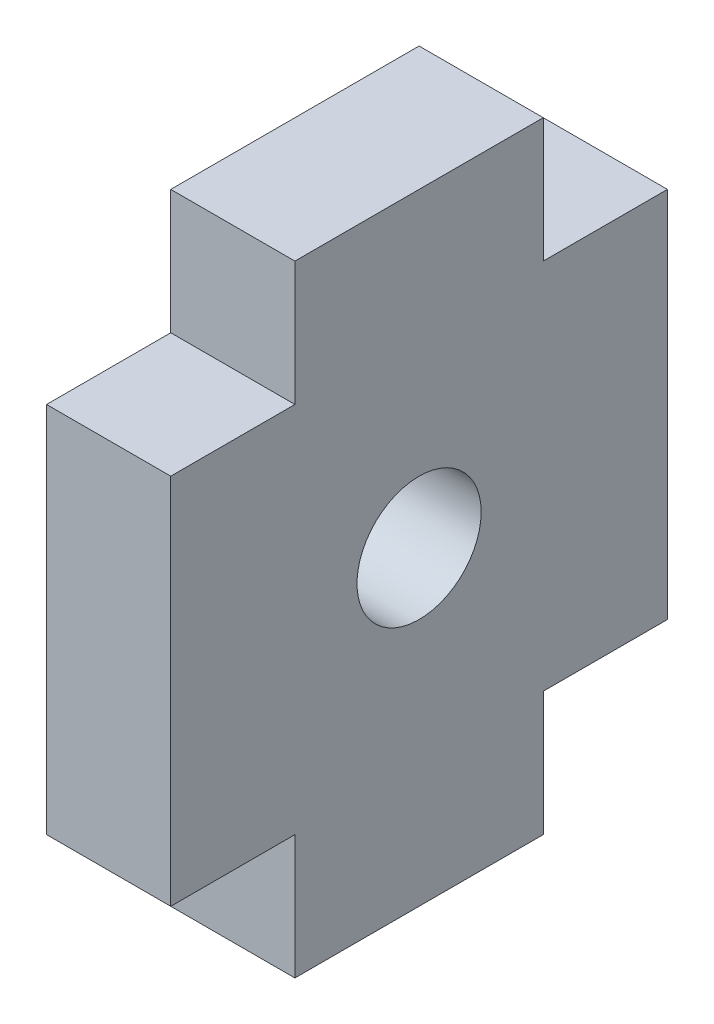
ISO-10303-21;
HEADER;
FILE_DESCRIPTION(('STEP AP214'),'2;1');
FILE_NAME('part.step','',(''),(''),'','','');
FILE_SCHEMA(('AUTOMOTIVE_DESIGN { 1 0 10303 214 1 1 1 1 }'));
ENDSEC;
DATA;
#1=APPLICATION_CONTEXT('core data for automotive mechanical design processes');
#2=APPLICATION_PROTOCOL_DEFINITION('international standard','automotive_design',2000,#1);
#3=PRODUCT_CONTEXT('',#1,'mechanical');
#4=PRODUCT('Part','Part','',(#3));
#5=PRODUCT_RELATED_PRODUCT_CATEGORY('part','',(#4));
#6=PRODUCT_DEFINITION_FORMATION('','',#4);
#7=PRODUCT_DEFINITION_CONTEXT('part definition',#1,'design');
#8=PRODUCT_DEFINITION('design','',#6,#7);
#9=PRODUCT_DEFINITION_SHAPE('','',#8);
#10=(LENGTH_UNIT() NAMED_UNIT(*) SI_UNIT(.MILLI.,.METRE.));
#11=(NAMED_UNIT(*) PLANE_ANGLE_UNIT() SI_UNIT($,.RADIAN.));
#12=(NAMED_UNIT(*) SI_UNIT($,.STERADIAN.) SOLID_ANGLE_UNIT());
#13=UNCERTAINTY_MEASURE_WITH_UNIT(LENGTH_MEASURE(1.E-05),#10,'distance_accuracy_value','');
#14=(GEOMETRIC_REPRESENTATION_CONTEXT(3) GLOBAL_UNCERTAINTY_ASSIGNED_CONTEXT((#13)) GLOBAL_UNIT_ASSIGNED_CONTEXT((#10,
#11,#12)) REPRESENTATION_CONTEXT('',''));
#15=CARTESIAN_POINT('',(0.,0.,0.));
#16=DIRECTION('',(0.,0.,1.));
#17=DIRECTION('',(1.,0.,0.));
#18=AXIS2_PLACEMENT_3D('',#15,#16,#17);
#19=CARTESIAN_POINT('',(3.175,0.,0.));
#20=DIRECTION('',(-1.,0.,0.));
#21=DIRECTION('',(0.,0.,1.));
#22=AXIS2_PLACEMENT_3D('',#19,#20,#21);
#23=PLANE('',#22);
#24=DIRECTION('',(0.,0.,-1.));
#25=VECTOR('',#24,1.);
#26=CARTESIAN_POINT('',(3.175,-9.525,-6.35));
#27=LINE('',#26,#25);
#28=CARTESIAN_POINT('',(3.175,-9.525,-6.35));
#29=VERTEX_POINT('',#28);
#30=CARTESIAN_POINT('',(3.175,-9.525,-12.7));
#31=VERTEX_POINT('',#30);
#32=EDGE_CURVE('E178',#29,#31,#27,.T.);
#33=ORIENTED_EDGE('',*,*,#32,.T.);
#34=DIRECTION('',(0.,1.,0.));
#35=VECTOR('',#34,1.);
#36=CARTESIAN_POINT('',(3.175,9.525,-12.7));
#37=LINE('',#36,#35);
#38=CARTESIAN_POINT('',(3.175,9.525,-12.7));
#39=VERTEX_POINT('',#38);
#40=EDGE_CURVE('E106',#31,#39,#37,.T.);
#41=ORIENTED_EDGE('',*,*,#40,.T.);
#42=DIRECTION('',(0.,0.,1.));
#43=VECTOR('',#42,1.);
#44=CARTESIAN_POINT('',(3.175,9.525,-6.35));
#45=LINE('',#44,#43);
#46=CARTESIAN_POINT('',(3.175,9.525,-6.35));
#47=VERTEX_POINT('',#46);
#48=EDGE_CURVE('E205',#39,#47,#45,.T.);
#49=ORIENTED_EDGE('',*,*,#48,.T.);
#50=DIRECTION('',(0.,1.,0.));
#51=VECTOR('',#50,1.);
#52=CARTESIAN_POINT('',(3.175,9.525,-6.35));
#53=LINE('',#52,#51);
#54=CARTESIAN_POINT('',(3.175,15.875,-6.35));
#55=VERTEX_POINT('',#54);
#56=EDGE_CURVE('E224',#47,#55,#53,.T.);
#57=ORIENTED_EDGE('',*,*,#56,.T.);
#58=DIRECTION('',(0.,0.,1.));
#59=VECTOR('',#58,1.);
#60=CARTESIAN_POINT('',(3.175,15.875,6.35));
#61=LINE('',#60,#59);
#62=CARTESIAN_POINT('',(3.175,15.875,6.35));
#63=VERTEX_POINT('',#62);
#64=EDGE_CURVE('E221',#55,#63,#61,.T.);
#65=ORIENTED_EDGE('',*,*,#64,.T.);
#66=DIRECTION('',(0.,-1.,0.));
#67=VECTOR('',#66,1.);
#68=CARTESIAN_POINT('',(3.175,9.525,6.35));
#69=LINE('',#68,#67);
#70=CARTESIAN_POINT('',(3.175,9.525,6.35));
#71=VERTEX_POINT('',#70);
#72=EDGE_CURVE('E223',#63,#71,#69,.T.);
#73=ORIENTED_EDGE('',*,*,#72,.T.);
#74=DIRECTION('',(0.,0.,1.));
#75=VECTOR('',#74,1.);
#76=CARTESIAN_POINT('',(3.175,9.525,12.7));
#77=LINE('',#76,#75);
#78=CARTESIAN_POINT('',(3.175,9.525,12.7));
#79=VERTEX_POINT('',#78);
#80=EDGE_CURVE('E226',#71,#79,#77,.T.);
#81=ORIENTED_EDGE('',*,*,#80,.T.);
#82=DIRECTION('',(0.,-1.,0.));
#83=VECTOR('',#82,1.);
#84=CARTESIAN_POINT('',(3.175,9.525,12.7));
#85=LINE('',#84,#83);
#86=CARTESIAN_POINT('',(3.175,-9.525,12.7));
#87=VERTEX_POINT('',#86);
#88=EDGE_CURVE('E232',#79,#87,#85,.T.);
#89=ORIENTED_EDGE('',*,*,#88,.T.);
#90=DIRECTION('',(0.,0.,-1.));
#91=VECTOR('',#90,1.);
#92=CARTESIAN_POINT('',(3.175,-9.525,12.7));
#93=LINE('',#92,#91);
#94=CARTESIAN_POINT('',(3.175,-9.525,6.35));
#95=VERTEX_POINT('',#94);
#96=EDGE_CURVE('E137',#87,#95,#93,.T.);
#97=ORIENTED_EDGE('',*,*,#96,.T.);
#98=DIRECTION('',(0.,-1.,0.));
#99=VECTOR('',#98,1.);
#100=CARTESIAN_POINT('',(3.175,-9.525,6.35));
#101=LINE('',#100,#99);
#102=CARTESIAN_POINT('',(3.175,-15.875,6.35));
#103=VERTEX_POINT('',#102);
#104=EDGE_CURVE('E131',#95,#103,#101,.T.);
#105=ORIENTED_EDGE('',*,*,#104,.T.);
#106=DIRECTION('',(0.,0.,-1.));
#107=VECTOR('',#106,1.);
#108=CARTESIAN_POINT('',(3.175,-15.875,6.35));
#109=LINE('',#108,#107);
#110=CARTESIAN_POINT('',(3.175,-15.875,-6.35));
#111=VERTEX_POINT('',#110);
#112=EDGE_CURVE('E135',#103,#111,#109,.T.);
#113=ORIENTED_EDGE('',*,*,#112,.T.);
#114=DIRECTION('',(0.,1.,0.));
#115=VECTOR('',#114,1.);
#116=CARTESIAN_POINT('',(3.175,-9.525,-6.35));
#117=LINE('',#116,#115);
#118=EDGE_CURVE('E51',#111,#29,#117,.T.);
#119=ORIENTED_EDGE('',*,*,#118,.T.);
#120=EDGE_LOOP('',(#33,#41,#49,#57,#65,#73,#81,#89,#97,#105,#113,#119));
#121=FACE_BOUND('',#120,.T.);
#122=CARTESIAN_POINT('',(3.175,0.,0.));
#123=DIRECTION('',(1.,0.,0.));
#124=DIRECTION('',(0.,0.,-1.));
#125=AXIS2_PLACEMENT_3D('',#122,#123,#124);
#126=CIRCLE('',#125,3.175);
#127=CARTESIAN_POINT('',(3.175,0.,-3.175));
#128=VERTEX_POINT('',#127);
#129=EDGE_CURVE('E159',#128,#128,#126,.T.);
#130=ORIENTED_EDGE('',*,*,#129,.F.);
#131=EDGE_LOOP('',(#130));
#132=FACE_BOUND('',#131,.T.);
#133=ADVANCED_FACE('F34',(#121,#132),#23,.F.);
#134=CARTESIAN_POINT('',(-3.175,0.,0.));
#135=DIRECTION('',(-1.,0.,0.));
#136=DIRECTION('',(0.,0.,1.));
#137=AXIS2_PLACEMENT_3D('',#134,#135,#136);
#138=PLANE('',#137);
#139=DIRECTION('',(0.,0.,-1.));
#140=VECTOR('',#139,1.);
#141=CARTESIAN_POINT('',(-3.175,-9.525,-6.35));
#142=LINE('',#141,#140);
#143=CARTESIAN_POINT('',(-3.175,-9.525,-6.35));
#144=VERTEX_POINT('',#143);
#145=CARTESIAN_POINT('',(-3.175,-9.525,-12.7));
#146=VERTEX_POINT('',#145);
#147=EDGE_CURVE('E155',#144,#146,#142,.T.);
#148=ORIENTED_EDGE('',*,*,#147,.F.);
#149=DIRECTION('',(0.,1.,0.));
#150=VECTOR('',#149,1.);
#151=CARTESIAN_POINT('',(-3.175,-9.525,-6.35));
#152=LINE('',#151,#150);
#153=CARTESIAN_POINT('',(-3.175,-15.875,-6.35));
#154=VERTEX_POINT('',#153);
#155=EDGE_CURVE('E98',#154,#144,#152,.T.);
#156=ORIENTED_EDGE('',*,*,#155,.F.);
#157=DIRECTION('',(0.,0.,-1.));
#158=VECTOR('',#157,1.);
#159=CARTESIAN_POINT('',(-3.175,-15.875,6.35));
#160=LINE('',#159,#158);
#161=CARTESIAN_POINT('',(-3.175,-15.875,6.35));
#162=VERTEX_POINT('',#161);
#163=EDGE_CURVE('E92',#162,#154,#160,.T.);
#164=ORIENTED_EDGE('',*,*,#163,.F.);
#165=DIRECTION('',(0.,-1.,0.));
#166=VECTOR('',#165,1.);
#167=CARTESIAN_POINT('',(-3.175,-9.525,6.35));
#168=LINE('',#167,#166);
#169=CARTESIAN_POINT('',(-3.175,-9.525,6.35));
#170=VERTEX_POINT('',#169);
#171=EDGE_CURVE('E145',#170,#162,#168,.T.);
#172=ORIENTED_EDGE('',*,*,#171,.F.);
#173=DIRECTION('',(0.,0.,-1.));
#174=VECTOR('',#173,1.);
#175=CARTESIAN_POINT('',(-3.175,-9.525,12.7));
#176=LINE('',#175,#174);
#177=CARTESIAN_POINT('',(-3.175,-9.525,12.7));
#178=VERTEX_POINT('',#177);
#179=EDGE_CURVE('E173',#178,#170,#176,.T.);
#180=ORIENTED_EDGE('',*,*,#179,.F.);
#181=DIRECTION('',(0.,-1.,0.));
#182=VECTOR('',#181,1.);
#183=CARTESIAN_POINT('',(-3.175,9.525,12.7));
#184=LINE('',#183,#182);
#185=CARTESIAN_POINT('',(-3.175,9.525,12.7));
#186=VERTEX_POINT('',#185);
#187=EDGE_CURVE('E171',#186,#178,#184,.T.);
#188=ORIENTED_EDGE('',*,*,#187,.F.);
#189=DIRECTION('',(0.,0.,1.));
#190=VECTOR('',#189,1.);
#191=CARTESIAN_POINT('',(-3.175,9.525,12.7));
#192=LINE('',#191,#190);
#193=CARTESIAN_POINT('',(-3.175,9.525,6.35));
#194=VERTEX_POINT('',#193);
#195=EDGE_CURVE('E169',#194,#186,#192,.T.);
#196=ORIENTED_EDGE('',*,*,#195,.F.);
#197=DIRECTION('',(0.,-1.,0.));
#198=VECTOR('',#197,1.);
#199=CARTESIAN_POINT('',(-3.175,9.525,6.35));
#200=LINE('',#199,#198);
#201=CARTESIAN_POINT('',(-3.175,15.875,6.35));
#202=VERTEX_POINT('',#201);
#203=EDGE_CURVE('E167',#202,#194,#200,.T.);
#204=ORIENTED_EDGE('',*,*,#203,.F.);
#205=DIRECTION('',(0.,0.,1.));
#206=VECTOR('',#205,1.);
#207=CARTESIAN_POINT('',(-3.175,15.875,6.35));
#208=LINE('',#207,#206);
#209=CARTESIAN_POINT('',(-3.175,15.875,-6.35));
#210=VERTEX_POINT('',#209);
#211=EDGE_CURVE('E165',#210,#202,#208,.T.);
#212=ORIENTED_EDGE('',*,*,#211,.F.);
#213=DIRECTION('',(0.,1.,0.));
#214=VECTOR('',#213,1.);
#215=CARTESIAN_POINT('',(-3.175,9.525,-6.35));
#216=LINE('',#215,#214);
#217=CARTESIAN_POINT('',(-3.175,9.525,-6.35));
#218=VERTEX_POINT('',#217);
#219=EDGE_CURVE('E163',#218,#210,#216,.T.);
#220=ORIENTED_EDGE('',*,*,#219,.F.);
#221=DIRECTION('',(0.,0.,1.));
#222=VECTOR('',#221,1.);
#223=CARTESIAN_POINT('',(-3.175,9.525,-6.35));
#224=LINE('',#223,#222);
#225=CARTESIAN_POINT('',(-3.175,9.525,-12.7));
#226=VERTEX_POINT('',#225);
#227=EDGE_CURVE('E161',#226,#218,#224,.T.);
#228=ORIENTED_EDGE('',*,*,#227,.F.);
#229=DIRECTION('',(0.,1.,0.));
#230=VECTOR('',#229,1.);
#231=CARTESIAN_POINT('',(-3.175,9.525,-12.7));
#232=LINE('',#231,#230);
#233=EDGE_CURVE('E158',#146,#226,#232,.T.);
#234=ORIENTED_EDGE('',*,*,#233,.F.);
#235=EDGE_LOOP('',(#148,#156,#164,#172,#180,#188,#196,#204,#212,#220,#228,#234));
#236=FACE_BOUND('',#235,.T.);
#237=CARTESIAN_POINT('',(-3.175,0.,0.));
#238=DIRECTION('',(1.,0.,0.));
#239=DIRECTION('',(0.,0.,-1.));
#240=AXIS2_PLACEMENT_3D('',#237,#238,#239);
#241=CIRCLE('',#240,3.175);
#242=CARTESIAN_POINT('',(-3.175,0.,-3.175));
#243=VERTEX_POINT('',#242);
#244=EDGE_CURVE('E379',#243,#243,#241,.T.);
#245=ORIENTED_EDGE('',*,*,#244,.T.);
#246=EDGE_LOOP('',(#245));
#247=FACE_BOUND('',#246,.T.);
#248=ADVANCED_FACE('F209',(#236,#247),#138,.T.);
#249=CARTESIAN_POINT('',(3.175,-9.525,-6.35));
#250=DIRECTION('',(0.,1.,0.));
#251=DIRECTION('',(0.,0.,1.));
#252=AXIS2_PLACEMENT_3D('',#249,#250,#251);
#253=PLANE('',#252);
#254=ORIENTED_EDGE('',*,*,#147,.T.);
#255=DIRECTION('',(-1.,0.,0.));
#256=VECTOR('',#255,1.);
#257=CARTESIAN_POINT('',(3.175,-9.525,-12.7));
#258=LINE('',#257,#256);
#259=EDGE_CURVE('E11',#31,#146,#258,.T.);
#260=ORIENTED_EDGE('',*,*,#259,.F.);
#261=ORIENTED_EDGE('',*,*,#32,.F.);
#262=DIRECTION('',(-1.,0.,0.));
#263=VECTOR('',#262,1.);
#264=CARTESIAN_POINT('',(3.175,-9.525,-6.35));
#265=LINE('',#264,#263);
#266=EDGE_CURVE('E151',#29,#144,#265,.T.);
#267=ORIENTED_EDGE('',*,*,#266,.T.);
#268=EDGE_LOOP('',(#254,#260,#261,#267));
#269=FACE_BOUND('',#268,.T.);
#270=ADVANCED_FACE('F36',(#269),#253,.F.);
#271=CARTESIAN_POINT('',(3.175,9.525,-12.7));
#272=DIRECTION('',(0.,0.,1.));
#273=DIRECTION('',(1.,0.,0.));
#274=AXIS2_PLACEMENT_3D('',#271,#272,#273);
#275=PLANE('',#274);
#276=ORIENTED_EDGE('',*,*,#233,.T.);
#277=DIRECTION('',(-1.,0.,0.));
#278=VECTOR('',#277,1.);
#279=CARTESIAN_POINT('',(3.175,9.525,-12.7));
#280=LINE('',#279,#278);
#281=EDGE_CURVE('E43',#39,#226,#280,.T.);
#282=ORIENTED_EDGE('',*,*,#281,.F.);
#283=ORIENTED_EDGE('',*,*,#40,.F.);
#284=ORIENTED_EDGE('',*,*,#259,.T.);
#285=EDGE_LOOP('',(#276,#282,#283,#284));
#286=FACE_BOUND('',#285,.T.);
#287=ADVANCED_FACE('F266',(#286),#275,.F.);
#288=CARTESIAN_POINT('',(3.175,9.525,-6.35));
#289=DIRECTION('',(0.,-1.,0.));
#290=DIRECTION('',(0.,0.,-1.));
#291=AXIS2_PLACEMENT_3D('',#288,#289,#290);
#292=PLANE('',#291);
#293=ORIENTED_EDGE('',*,*,#227,.T.);
#294=DIRECTION('',(-1.,0.,0.));
#295=VECTOR('',#294,1.);
#296=CARTESIAN_POINT('',(3.175,9.525,-6.35));
#297=LINE('',#296,#295);
#298=EDGE_CURVE('E197',#47,#218,#297,.T.);
#299=ORIENTED_EDGE('',*,*,#298,.F.);
#300=ORIENTED_EDGE('',*,*,#48,.F.);
#301=ORIENTED_EDGE('',*,*,#281,.T.);
#302=EDGE_LOOP('',(#293,#299,#300,#301));
#303=FACE_BOUND('',#302,.T.);
#304=ADVANCED_FACE('F203',(#303),#292,.F.);
#305=CARTESIAN_POINT('',(3.175,9.525,-6.35));
#306=DIRECTION('',(0.,0.,1.));
#307=DIRECTION('',(1.,0.,0.));
#308=AXIS2_PLACEMENT_3D('',#305,#306,#307);
#309=PLANE('',#308);
#310=ORIENTED_EDGE('',*,*,#219,.T.);
#311=DIRECTION('',(-1.,0.,0.));
#312=VECTOR('',#311,1.);
#313=CARTESIAN_POINT('',(3.175,15.875,-6.35));
#314=LINE('',#313,#312);
#315=EDGE_CURVE('E194',#55,#210,#314,.T.);
#316=ORIENTED_EDGE('',*,*,#315,.F.);
#317=ORIENTED_EDGE('',*,*,#56,.F.);
#318=ORIENTED_EDGE('',*,*,#298,.T.);
#319=EDGE_LOOP('',(#310,#316,#317,#318));
#320=FACE_BOUND('',#319,.T.);
#321=ADVANCED_FACE('F215',(#320),#309,.F.);
#322=CARTESIAN_POINT('',(3.175,15.875,6.35));
#323=DIRECTION('',(0.,-1.,0.));
#324=DIRECTION('',(0.,0.,-1.));
#325=AXIS2_PLACEMENT_3D('',#322,#323,#324);
#326=PLANE('',#325);
#327=ORIENTED_EDGE('',*,*,#211,.T.);
#328=DIRECTION('',(-1.,0.,0.));
#329=VECTOR('',#328,1.);
#330=CARTESIAN_POINT('',(3.175,15.875,6.35));
#331=LINE('',#330,#329);
#332=EDGE_CURVE('E191',#63,#202,#331,.T.);
#333=ORIENTED_EDGE('',*,*,#332,.F.);
#334=ORIENTED_EDGE('',*,*,#64,.F.);
#335=ORIENTED_EDGE('',*,*,#315,.T.);
#336=EDGE_LOOP('',(#327,#333,#334,#335));
#337=FACE_BOUND('',#336,.T.);
#338=ADVANCED_FACE('F219',(#337),#326,.F.);
#339=CARTESIAN_POINT('',(3.175,9.525,6.35));
#340=DIRECTION('',(0.,0.,-1.));
#341=DIRECTION('',(-1.,0.,0.));
#342=AXIS2_PLACEMENT_3D('',#339,#340,#341);
#343=PLANE('',#342);
#344=ORIENTED_EDGE('',*,*,#203,.T.);
#345=DIRECTION('',(-1.,0.,0.));
#346=VECTOR('',#345,1.);
#347=CARTESIAN_POINT('',(3.175,9.525,6.35));
#348=LINE('',#347,#346);
#349=EDGE_CURVE('E188',#71,#194,#348,.T.);
#350=ORIENTED_EDGE('',*,*,#349,.F.);
#351=ORIENTED_EDGE('',*,*,#72,.F.);
#352=ORIENTED_EDGE('',*,*,#332,.T.);
#353=EDGE_LOOP('',(#344,#350,#351,#352));
#354=FACE_BOUND('',#353,.T.);
#355=ADVANCED_FACE('F279',(#354),#343,.F.);
#356=CARTESIAN_POINT('',(3.175,9.525,12.7));
#357=DIRECTION('',(0.,-1.,0.));
#358=DIRECTION('',(0.,0.,-1.));
#359=AXIS2_PLACEMENT_3D('',#356,#357,#358);
#360=PLANE('',#359);
#361=ORIENTED_EDGE('',*,*,#195,.T.);
#362=DIRECTION('',(-1.,0.,0.));
#363=VECTOR('',#362,1.);
#364=CARTESIAN_POINT('',(3.175,9.525,12.7));
#365=LINE('',#364,#363);
#366=EDGE_CURVE('E185',#79,#186,#365,.T.);
#367=ORIENTED_EDGE('',*,*,#366,.F.);
#368=ORIENTED_EDGE('',*,*,#80,.F.);
#369=ORIENTED_EDGE('',*,*,#349,.T.);
#370=EDGE_LOOP('',(#361,#367,#368,#369));
#371=FACE_BOUND('',#370,.T.);
#372=ADVANCED_FACE('F282',(#371),#360,.F.);
#373=CARTESIAN_POINT('',(3.175,9.525,12.7));
#374=DIRECTION('',(0.,0.,-1.));
#375=DIRECTION('',(-1.,0.,0.));
#376=AXIS2_PLACEMENT_3D('',#373,#374,#375);
#377=PLANE('',#376);
#378=ORIENTED_EDGE('',*,*,#187,.T.);
#379=DIRECTION('',(-1.,0.,0.));
#380=VECTOR('',#379,1.);
#381=CARTESIAN_POINT('',(3.175,-9.525,12.7));
#382=LINE('',#381,#380);
#383=EDGE_CURVE('E182',#87,#178,#382,.T.);
#384=ORIENTED_EDGE('',*,*,#383,.F.);
#385=ORIENTED_EDGE('',*,*,#88,.F.);
#386=ORIENTED_EDGE('',*,*,#366,.T.);
#387=EDGE_LOOP('',(#378,#384,#385,#386));
#388=FACE_BOUND('',#387,.T.);
#389=ADVANCED_FACE('F238',(#388),#377,.F.);
#390=CARTESIAN_POINT('',(3.175,-9.525,12.7));
#391=DIRECTION('',(0.,1.,0.));
#392=DIRECTION('',(0.,0.,1.));
#393=AXIS2_PLACEMENT_3D('',#390,#391,#392);
#394=PLANE('',#393);
#395=ORIENTED_EDGE('',*,*,#179,.T.);
#396=DIRECTION('',(-1.,0.,0.));
#397=VECTOR('',#396,1.);
#398=CARTESIAN_POINT('',(3.175,-9.525,6.35));
#399=LINE('',#398,#397);
#400=EDGE_CURVE('E146',#95,#170,#399,.T.);
#401=ORIENTED_EDGE('',*,*,#400,.F.);
#402=ORIENTED_EDGE('',*,*,#96,.F.);
#403=ORIENTED_EDGE('',*,*,#383,.T.);
#404=EDGE_LOOP('',(#395,#401,#402,#403));
#405=FACE_BOUND('',#404,.T.);
#406=ADVANCED_FACE('F242',(#405),#394,.F.);
#407=CARTESIAN_POINT('',(3.175,-9.525,6.35));
#408=DIRECTION('',(0.,0.,-1.));
#409=DIRECTION('',(-1.,0.,0.));
#410=AXIS2_PLACEMENT_3D('',#407,#408,#409);
#411=PLANE('',#410);
#412=ORIENTED_EDGE('',*,*,#171,.T.);
#413=DIRECTION('',(-1.,0.,0.));
#414=VECTOR('',#413,1.);
#415=CARTESIAN_POINT('',(3.175,-15.875,6.35));
#416=LINE('',#415,#414);
#417=EDGE_CURVE('E142',#103,#162,#416,.T.);
#418=ORIENTED_EDGE('',*,*,#417,.F.);
#419=ORIENTED_EDGE('',*,*,#104,.F.);
#420=ORIENTED_EDGE('',*,*,#400,.T.);
#421=EDGE_LOOP('',(#412,#418,#419,#420));
#422=FACE_BOUND('',#421,.T.);
#423=ADVANCED_FACE('F143',(#422),#411,.F.);
#424=CARTESIAN_POINT('',(3.175,-15.875,6.35));
#425=DIRECTION('',(0.,1.,0.));
#426=DIRECTION('',(0.,0.,1.));
#427=AXIS2_PLACEMENT_3D('',#424,#425,#426);
#428=PLANE('',#427);
#429=ORIENTED_EDGE('',*,*,#163,.T.);
#430=DIRECTION('',(-1.,0.,0.));
#431=VECTOR('',#430,1.);
#432=CARTESIAN_POINT('',(3.175,-15.875,-6.35));
#433=LINE('',#432,#431);
#434=EDGE_CURVE('E147',#111,#154,#433,.T.);
#435=ORIENTED_EDGE('',*,*,#434,.F.);
#436=ORIENTED_EDGE('',*,*,#112,.F.);
#437=ORIENTED_EDGE('',*,*,#417,.T.);
#438=EDGE_LOOP('',(#429,#435,#436,#437));
#439=FACE_BOUND('',#438,.T.);
#440=ADVANCED_FACE('F149',(#439),#428,.F.);
#441=CARTESIAN_POINT('',(3.175,-9.525,-6.35));
#442=DIRECTION('',(0.,0.,1.));
#443=DIRECTION('',(1.,0.,0.));
#444=AXIS2_PLACEMENT_3D('',#441,#442,#443);
#445=PLANE('',#444);
#446=ORIENTED_EDGE('',*,*,#155,.T.);
#447=ORIENTED_EDGE('',*,*,#266,.F.);
#448=ORIENTED_EDGE('',*,*,#118,.F.);
#449=ORIENTED_EDGE('',*,*,#434,.T.);
#450=EDGE_LOOP('',(#446,#447,#448,#449));
#451=FACE_BOUND('',#450,.T.);
#452=ADVANCED_FACE('F246',(#451),#445,.F.);
#453=CARTESIAN_POINT('',(3.175,0.,0.));
#454=DIRECTION('',(-1.,0.,0.));
#455=DIRECTION('',(0.,0.,1.));
#456=AXIS2_PLACEMENT_3D('',#453,#454,#455);
#457=CYLINDRICAL_SURFACE('',#456,3.175);
#458=ORIENTED_EDGE('',*,*,#129,.T.);
#459=EDGE_LOOP('',(#458));
#460=FACE_BOUND('',#459,.T.);
#461=ORIENTED_EDGE('',*,*,#244,.F.);
#462=EDGE_LOOP('',(#461));
#463=FACE_BOUND('',#462,.T.);
#464=ADVANCED_FACE('F248',(#460,#463),#457,.F.);
#465=CLOSED_SHELL('',(#133,#248,#270,#287,#304,#321,#338,#355,#372,#389,#406,#423,#440,#452,#464));
#466=MANIFOLD_SOLID_BREP('B2',#465);
#467=ADVANCED_BREP_SHAPE_REPRESENTATION('',(#18,#466),#14);
#468=SHAPE_DEFINITION_REPRESENTATION(#9,#467);
ENDSEC;
END-ISO-10303-21;
